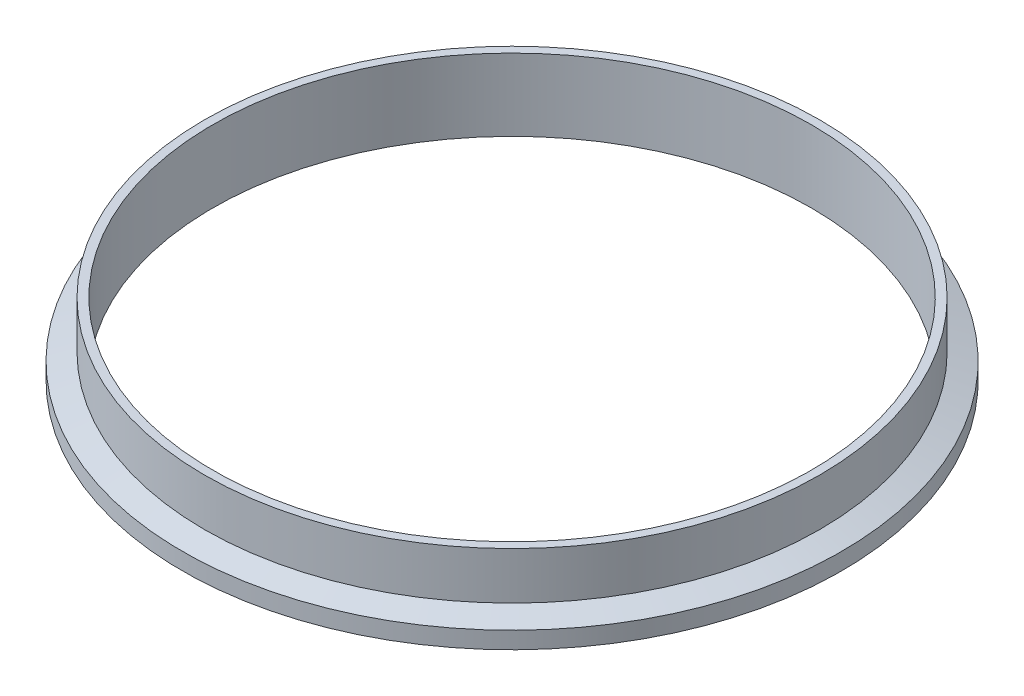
ISO-10303-21;
HEADER;
FILE_DESCRIPTION(('STEP AP214'),'2;1');
FILE_NAME('part.step','',(''),(''),'','','');
FILE_SCHEMA(('AUTOMOTIVE_DESIGN { 1 0 10303 214 1 1 1 1 }'));
ENDSEC;
DATA;
#1=APPLICATION_CONTEXT('core data for automotive mechanical design processes');
#2=APPLICATION_PROTOCOL_DEFINITION('international standard','automotive_design',2000,#1);
#3=PRODUCT_CONTEXT('',#1,'mechanical');
#4=PRODUCT('Part','Part','',(#3));
#5=PRODUCT_RELATED_PRODUCT_CATEGORY('part','',(#4));
#6=PRODUCT_DEFINITION_FORMATION('','',#4);
#7=PRODUCT_DEFINITION_CONTEXT('part definition',#1,'design');
#8=PRODUCT_DEFINITION('design','',#6,#7);
#9=PRODUCT_DEFINITION_SHAPE('','',#8);
#10=(LENGTH_UNIT() NAMED_UNIT(*) SI_UNIT(.MILLI.,.METRE.));
#11=(NAMED_UNIT(*) PLANE_ANGLE_UNIT() SI_UNIT($,.RADIAN.));
#12=(NAMED_UNIT(*) SI_UNIT($,.STERADIAN.) SOLID_ANGLE_UNIT());
#13=UNCERTAINTY_MEASURE_WITH_UNIT(LENGTH_MEASURE(1.E-05),#10,'distance_accuracy_value','');
#14=(GEOMETRIC_REPRESENTATION_CONTEXT(3) GLOBAL_UNCERTAINTY_ASSIGNED_CONTEXT((#13)) GLOBAL_UNIT_ASSIGNED_CONTEXT((#10,
#11,#12)) REPRESENTATION_CONTEXT('',''));
#15=CARTESIAN_POINT('',(0.,0.,0.));
#16=DIRECTION('',(0.,0.,1.));
#17=DIRECTION('',(1.,0.,0.));
#18=AXIS2_PLACEMENT_3D('',#15,#16,#17);
#19=CARTESIAN_POINT('',(0.,0.787399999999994,0.));
#20=DIRECTION('',(0.,-1.00000000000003,0.));
#21=DIRECTION('',(0.,0.,-1.00000000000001));
#22=AXIS2_PLACEMENT_3D('',#19,#20,#21);
#23=TOROIDAL_SURFACE('',#22,105.399208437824,0.787400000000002);
#24=CARTESIAN_POINT('',(0.,0.,0.));
#25=DIRECTION('',(0.,-1.00000000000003,0.));
#26=DIRECTION('',(0.,0.,-1.00000000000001));
#27=AXIS2_PLACEMENT_3D('',#24,#25,#26);
#28=CIRCLE('',#27,105.399208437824);
#29=CARTESIAN_POINT('',(-1.05314965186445E-12,-1.69418221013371E-13,-105.399208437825));
#30=VERTEX_POINT('',#29);
#31=EDGE_CURVE('E74',#30,#30,#28,.T.);
#32=ORIENTED_EDGE('',*,*,#31,.T.);
#33=EDGE_LOOP('',(#32));
#34=FACE_BOUND('',#33,.T.);
#35=CARTESIAN_POINT('',(0.,0.474458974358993,0.));
#36=DIRECTION('',(0.,-1.00000000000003,0.));
#37=DIRECTION('',(0.,0.,-1.00000000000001));
#38=AXIS2_PLACEMENT_3D('',#35,#36,#37);
#39=CIRCLE('',#38,104.676666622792);
#40=CARTESIAN_POINT('',(-1.04593000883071E-12,0.474458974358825,-104.676666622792));
#41=VERTEX_POINT('',#40);
#42=EDGE_CURVE('E12',#41,#41,#39,.T.);
#43=ORIENTED_EDGE('',*,*,#42,.F.);
#44=EDGE_LOOP('',(#43));
#45=FACE_BOUND('',#44,.T.);
#46=ADVANCED_FACE('F40',(#34,#45),#23,.T.);
#47=CARTESIAN_POINT('',(0.,0.,0.));
#48=DIRECTION('',(0.,-1.00000000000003,0.));
#49=DIRECTION('',(0.,0.,-1.00000000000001));
#50=AXIS2_PLACEMENT_3D('',#47,#48,#49);
#51=TOROIDAL_SURFACE('',#50,103.5812,1.1938);
#52=CARTESIAN_POINT('',(0.,0.474458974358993,0.));
#53=DIRECTION('',(0.,-1.00000000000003,0.));
#54=DIRECTION('',(0.,0.,-1.00000000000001));
#55=AXIS2_PLACEMENT_3D('',#52,#53,#54);
#56=CIRCLE('',#55,102.485733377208);
#57=CARTESIAN_POINT('',(-1.02403818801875E-12,0.474458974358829,-102.485733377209));
#58=VERTEX_POINT('',#57);
#59=EDGE_CURVE('E46',#58,#58,#56,.T.);
#60=ORIENTED_EDGE('',*,*,#59,.F.);
#61=EDGE_LOOP('',(#60));
#62=FACE_BOUND('',#61,.T.);
#63=ORIENTED_EDGE('',*,*,#42,.T.);
#64=EDGE_LOOP('',(#63));
#65=FACE_BOUND('',#64,.T.);
#66=ADVANCED_FACE('F122',(#62,#65),#51,.F.);
#67=CARTESIAN_POINT('',(0.,0.787399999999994,0.));
#68=DIRECTION('',(0.,-1.00000000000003,0.));
#69=DIRECTION('',(0.,0.,-1.00000000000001));
#70=AXIS2_PLACEMENT_3D('',#67,#68,#69);
#71=TOROIDAL_SURFACE('',#70,101.763191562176,0.787399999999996);
#72=ORIENTED_EDGE('',*,*,#59,.T.);
#73=EDGE_LOOP('',(#72));
#74=FACE_BOUND('',#73,.T.);
#75=CARTESIAN_POINT('',(0.,0.,0.));
#76=DIRECTION('',(0.,-1.00000000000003,0.));
#77=DIRECTION('',(0.,0.,-1.00000000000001));
#78=AXIS2_PLACEMENT_3D('',#75,#76,#77);
#79=CIRCLE('',#78,101.763191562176);
#80=CARTESIAN_POINT('',(-1.01681854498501E-12,-1.63573703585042E-13,-101.763191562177));
#81=VERTEX_POINT('',#80);
#82=EDGE_CURVE('E50',#81,#81,#79,.T.);
#83=ORIENTED_EDGE('',*,*,#82,.F.);
#84=EDGE_LOOP('',(#83));
#85=FACE_BOUND('',#84,.T.);
#86=ADVANCED_FACE('F118',(#74,#85),#71,.T.);
#87=CARTESIAN_POINT('',(0.,0.,0.));
#88=DIRECTION('',(0.,1.00000000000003,0.));
#89=DIRECTION('',(0.,0.,1.00000000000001));
#90=AXIS2_PLACEMENT_3D('',#87,#88,#89);
#91=PLANE('',#90);
#92=CARTESIAN_POINT('',(0.,0.,0.));
#93=DIRECTION('',(0.,-1.00000000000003,0.));
#94=DIRECTION('',(0.,0.,-1.00000000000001));
#95=AXIS2_PLACEMENT_3D('',#92,#93,#94);
#96=CIRCLE('',#95,98.8314);
#97=CARTESIAN_POINT('',(-9.87524062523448E-13,-1.58861154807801E-13,-98.8314000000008));
#98=VERTEX_POINT('',#97);
#99=EDGE_CURVE('E54',#98,#98,#96,.T.);
#100=ORIENTED_EDGE('',*,*,#99,.F.);
#101=EDGE_LOOP('',(#100));
#102=FACE_BOUND('',#101,.T.);
#103=ORIENTED_EDGE('',*,*,#82,.T.);
#104=EDGE_LOOP('',(#103));
#105=FACE_BOUND('',#104,.T.);
#106=ADVANCED_FACE('F112',(#102,#105),#91,.F.);
#107=CARTESIAN_POINT('',(0.,0.,0.));
#108=DIRECTION('',(0.,-1.00000000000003,0.));
#109=DIRECTION('',(0.,0.,-1.00000000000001));
#110=AXIS2_PLACEMENT_3D('',#107,#108,#109);
#111=CYLINDRICAL_SURFACE('',#110,98.8314);
#112=ORIENTED_EDGE('',*,*,#99,.T.);
#113=EDGE_LOOP('',(#112));
#114=FACE_BOUND('',#113,.T.);
#115=CARTESIAN_POINT('',(-1.11022302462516E-13,23.8252,-2.4980018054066E-13));
#116=DIRECTION('',(0.,-1.00000000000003,0.));
#117=DIRECTION('',(0.,0.,-1.00000000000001));
#118=AXIS2_PLACEMENT_3D('',#115,#116,#117);
#119=CIRCLE('',#118,98.8314);
#120=CARTESIAN_POINT('',(-1.09854636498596E-12,23.8251999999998,-98.831400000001));
#121=VERTEX_POINT('',#120);
#122=EDGE_CURVE('E59',#121,#121,#119,.T.);
#123=ORIENTED_EDGE('',*,*,#122,.F.);
#124=EDGE_LOOP('',(#123));
#125=FACE_BOUND('',#124,.T.);
#126=ADVANCED_FACE('F107',(#114,#125),#111,.F.);
#127=CARTESIAN_POINT('',(-1.11022302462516E-13,23.8252,-2.4980018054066E-13));
#128=DIRECTION('',(0.,-1.00000000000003,0.));
#129=DIRECTION('',(0.,0.,-1.00000000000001));
#130=AXIS2_PLACEMENT_3D('',#127,#128,#129);
#131=PLANE('',#130);
#132=CARTESIAN_POINT('',(-1.11022302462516E-13,23.8252,-2.4980018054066E-13));
#133=DIRECTION('',(0.,-1.00000000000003,0.));
#134=DIRECTION('',(0.,0.,-1.00000000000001));
#135=AXIS2_PLACEMENT_3D('',#132,#133,#134);
#136=CIRCLE('',#135,101.6);
#137=CARTESIAN_POINT('',(-1.12621023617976E-12,23.8251999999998,-101.600000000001));
#138=VERTEX_POINT('',#137);
#139=EDGE_CURVE('E62',#138,#138,#136,.T.);
#140=ORIENTED_EDGE('',*,*,#139,.F.);
#141=EDGE_LOOP('',(#140));
#142=FACE_BOUND('',#141,.T.);
#143=ORIENTED_EDGE('',*,*,#122,.T.);
#144=EDGE_LOOP('',(#143));
#145=FACE_BOUND('',#144,.T.);
#146=ADVANCED_FACE('F101',(#142,#145),#131,.F.);
#147=CARTESIAN_POINT('',(0.,0.,0.));
#148=DIRECTION('',(0.,-1.00000000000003,0.));
#149=DIRECTION('',(0.,0.,-1.00000000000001));
#150=AXIS2_PLACEMENT_3D('',#147,#148,#149);
#151=CYLINDRICAL_SURFACE('',#150,101.6);
#152=CARTESIAN_POINT('',(0.,8.22278052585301,0.));
#153=DIRECTION('',(0.,-1.00000000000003,0.));
#154=DIRECTION('',(0.,0.,-1.00000000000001));
#155=AXIS2_PLACEMENT_3D('',#152,#153,#154);
#156=CIRCLE('',#155,101.6);
#157=CARTESIAN_POINT('',(-1.01518793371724E-12,8.22278052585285,-101.600000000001));
#158=VERTEX_POINT('',#157);
#159=EDGE_CURVE('E65',#158,#158,#156,.T.);
#160=ORIENTED_EDGE('',*,*,#159,.F.);
#161=EDGE_LOOP('',(#160));
#162=FACE_BOUND('',#161,.T.);
#163=ORIENTED_EDGE('',*,*,#139,.T.);
#164=EDGE_LOOP('',(#163));
#165=FACE_BOUND('',#164,.T.);
#166=ADVANCED_FACE('F95',(#162,#165),#151,.T.);
#167=CARTESIAN_POINT('',(0.,8.22278052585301,0.));
#168=DIRECTION('',(0.,-1.00000000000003,0.));
#169=DIRECTION('',(0.,0.,-1.00000000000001));
#170=AXIS2_PLACEMENT_3D('',#167,#168,#169);
#171=CONICAL_SURFACE('',#170,101.6,1.22173047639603);
#172=CARTESIAN_POINT('',(0.,5.58799999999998,0.));
#173=DIRECTION('',(0.,-1.00000000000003,0.));
#174=DIRECTION('',(0.,0.,-1.00000000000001));
#175=AXIS2_PLACEMENT_3D('',#172,#173,#174);
#176=CIRCLE('',#175,108.839);
#177=CARTESIAN_POINT('',(-1.0875200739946E-12,5.58799999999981,-108.839000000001));
#178=VERTEX_POINT('',#177);
#179=EDGE_CURVE('E68',#178,#178,#176,.T.);
#180=ORIENTED_EDGE('',*,*,#179,.F.);
#181=EDGE_LOOP('',(#180));
#182=FACE_BOUND('',#181,.T.);
#183=ORIENTED_EDGE('',*,*,#159,.T.);
#184=EDGE_LOOP('',(#183));
#185=FACE_BOUND('',#184,.T.);
#186=ADVANCED_FACE('F89',(#182,#185),#171,.T.);
#187=CARTESIAN_POINT('',(0.,0.,0.));
#188=DIRECTION('',(0.,-1.00000000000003,0.));
#189=DIRECTION('',(0.,0.,-1.00000000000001));
#190=AXIS2_PLACEMENT_3D('',#187,#188,#189);
#191=CYLINDRICAL_SURFACE('',#190,108.839);
#192=CARTESIAN_POINT('',(0.,0.,0.));
#193=DIRECTION('',(0.,-1.00000000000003,0.));
#194=DIRECTION('',(0.,0.,-1.00000000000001));
#195=AXIS2_PLACEMENT_3D('',#192,#193,#194);
#196=CIRCLE('',#195,108.839);
#197=CARTESIAN_POINT('',(-1.0875200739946E-12,-1.74947326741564E-13,-108.839000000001));
#198=VERTEX_POINT('',#197);
#199=EDGE_CURVE('E71',#198,#198,#196,.T.);
#200=ORIENTED_EDGE('',*,*,#199,.F.);
#201=EDGE_LOOP('',(#200));
#202=FACE_BOUND('',#201,.T.);
#203=ORIENTED_EDGE('',*,*,#179,.T.);
#204=EDGE_LOOP('',(#203));
#205=FACE_BOUND('',#204,.T.);
#206=ADVANCED_FACE('F83',(#202,#205),#191,.T.);
#207=CARTESIAN_POINT('',(0.,0.,0.));
#208=DIRECTION('',(0.,1.00000000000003,0.));
#209=DIRECTION('',(0.,0.,1.00000000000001));
#210=AXIS2_PLACEMENT_3D('',#207,#208,#209);
#211=PLANE('',#210);
#212=ORIENTED_EDGE('',*,*,#31,.F.);
#213=EDGE_LOOP('',(#212));
#214=FACE_BOUND('',#213,.T.);
#215=ORIENTED_EDGE('',*,*,#199,.T.);
#216=EDGE_LOOP('',(#215));
#217=FACE_BOUND('',#216,.T.);
#218=ADVANCED_FACE('F80',(#214,#217),#211,.F.);
#219=CLOSED_SHELL('',(#46,#66,#86,#106,#126,#146,#166,#186,#206,#218));
#220=MANIFOLD_SOLID_BREP('B2',#219);
#221=ADVANCED_BREP_SHAPE_REPRESENTATION('',(#18,#220),#14);
#222=SHAPE_DEFINITION_REPRESENTATION(#9,#221);
ENDSEC;
END-ISO-10303-21;
